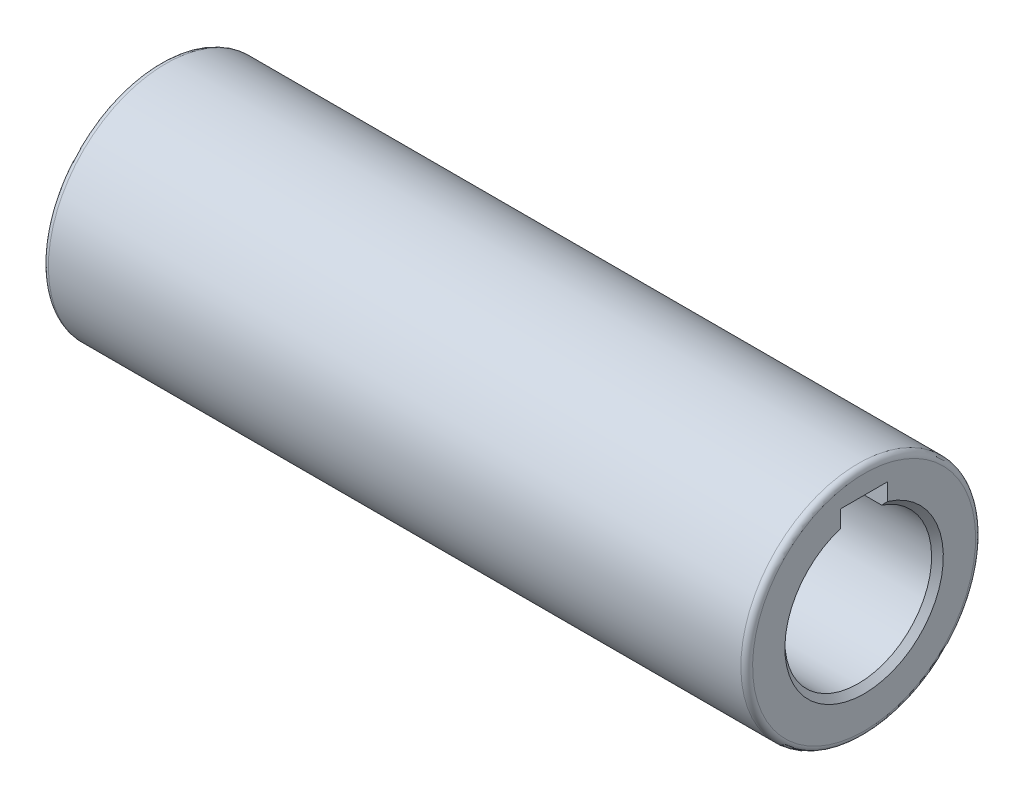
ISO-10303-21;
HEADER;
FILE_DESCRIPTION(('STEP AP214'),'2;1');
FILE_NAME('part.step','',(''),(''),'','','');
FILE_SCHEMA(('AUTOMOTIVE_DESIGN { 1 0 10303 214 1 1 1 1 }'));
ENDSEC;
DATA;
#1=APPLICATION_CONTEXT('core data for automotive mechanical design processes');
#2=APPLICATION_PROTOCOL_DEFINITION('international standard','automotive_design',2000,#1);
#3=PRODUCT_CONTEXT('',#1,'mechanical');
#4=PRODUCT('Part','Part','',(#3));
#5=PRODUCT_RELATED_PRODUCT_CATEGORY('part','',(#4));
#6=PRODUCT_DEFINITION_FORMATION('','',#4);
#7=PRODUCT_DEFINITION_CONTEXT('part definition',#1,'design');
#8=PRODUCT_DEFINITION('design','',#6,#7);
#9=PRODUCT_DEFINITION_SHAPE('','',#8);
#10=(LENGTH_UNIT() NAMED_UNIT(*) SI_UNIT(.MILLI.,.METRE.));
#11=(NAMED_UNIT(*) PLANE_ANGLE_UNIT() SI_UNIT($,.RADIAN.));
#12=(NAMED_UNIT(*) SI_UNIT($,.STERADIAN.) SOLID_ANGLE_UNIT());
#13=UNCERTAINTY_MEASURE_WITH_UNIT(LENGTH_MEASURE(1.E-05),#10,'distance_accuracy_value','');
#14=(GEOMETRIC_REPRESENTATION_CONTEXT(3) GLOBAL_UNCERTAINTY_ASSIGNED_CONTEXT((#13)) GLOBAL_UNIT_ASSIGNED_CONTEXT((#10,
#11,#12)) REPRESENTATION_CONTEXT('',''));
#15=CARTESIAN_POINT('',(0.,0.,0.));
#16=DIRECTION('',(0.,0.,1.));
#17=DIRECTION('',(1.,0.,0.));
#18=AXIS2_PLACEMENT_3D('',#15,#16,#17);
#19=CARTESIAN_POINT('',(59.,63.,95.0000000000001));
#20=DIRECTION('',(-1.,0.,0.));
#21=DIRECTION('',(0.,0.,1.));
#22=AXIS2_PLACEMENT_3D('',#19,#20,#21);
#23=CYLINDRICAL_SURFACE('',#22,20.);
#24=CARTESIAN_POINT('',(-59.,63.,95.));
#25=DIRECTION('',(1.,0.,0.));
#26=DIRECTION('',(0.,-1.,0.));
#27=AXIS2_PLACEMENT_3D('',#24,#25,#26);
#28=CIRCLE('',#27,20.);
#29=CARTESIAN_POINT('',(-59.,43.,95.));
#30=VERTEX_POINT('',#29);
#31=EDGE_CURVE('E111',#30,#30,#28,.F.);
#32=ORIENTED_EDGE('',*,*,#31,.F.);
#33=EDGE_LOOP('',(#32));
#34=FACE_BOUND('',#33,.T.);
#35=CARTESIAN_POINT('',(59.,63.,95.0000000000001));
#36=DIRECTION('',(1.,0.,0.));
#37=DIRECTION('',(0.,-1.,0.));
#38=AXIS2_PLACEMENT_3D('',#35,#36,#37);
#39=CIRCLE('',#38,20.);
#40=CARTESIAN_POINT('',(59.,43.,95.0000000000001));
#41=VERTEX_POINT('',#40);
#42=EDGE_CURVE('E168',#41,#41,#39,.T.);
#43=ORIENTED_EDGE('',*,*,#42,.F.);
#44=EDGE_LOOP('',(#43));
#45=FACE_BOUND('',#44,.T.);
#46=ADVANCED_FACE('F16',(#34,#45),#23,.T.);
#47=CARTESIAN_POINT('',(59.,63.,95.0000000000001));
#48=DIRECTION('',(1.,0.,0.));
#49=DIRECTION('',(0.,-1.,0.));
#50=AXIS2_PLACEMENT_3D('',#47,#48,#49);
#51=TOROIDAL_SURFACE('',#50,19.,1.);
#52=ORIENTED_EDGE('',*,*,#42,.T.);
#53=EDGE_LOOP('',(#52));
#54=FACE_BOUND('',#53,.T.);
#55=CARTESIAN_POINT('',(60.,63.,95.0000000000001));
#56=DIRECTION('',(-1.,0.,0.));
#57=DIRECTION('',(0.,-1.,0.));
#58=AXIS2_PLACEMENT_3D('',#55,#56,#57);
#59=CIRCLE('',#58,19.0000000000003);
#60=CARTESIAN_POINT('',(60.,43.9999999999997,95.0000000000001));
#61=VERTEX_POINT('',#60);
#62=EDGE_CURVE('E110',#61,#61,#59,.F.);
#63=ORIENTED_EDGE('',*,*,#62,.F.);
#64=EDGE_LOOP('',(#63));
#65=FACE_BOUND('',#64,.T.);
#66=ADVANCED_FACE('F160',(#54,#65),#51,.T.);
#67=CARTESIAN_POINT('',(-59.,63.,95.));
#68=DIRECTION('',(1.,0.,0.));
#69=DIRECTION('',(0.,-1.,0.));
#70=AXIS2_PLACEMENT_3D('',#67,#68,#69);
#71=TOROIDAL_SURFACE('',#70,19.,1.);
#72=CARTESIAN_POINT('',(-60.0000000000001,63.,95.));
#73=DIRECTION('',(1.,0.,0.));
#74=DIRECTION('',(0.,-1.,0.));
#75=AXIS2_PLACEMENT_3D('',#72,#73,#74);
#76=CIRCLE('',#75,19.0000000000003);
#77=CARTESIAN_POINT('',(-60.0000000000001,43.9999999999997,95.));
#78=VERTEX_POINT('',#77);
#79=EDGE_CURVE('E124',#78,#78,#76,.T.);
#80=ORIENTED_EDGE('',*,*,#79,.T.);
#81=EDGE_LOOP('',(#80));
#82=FACE_BOUND('',#81,.T.);
#83=ORIENTED_EDGE('',*,*,#31,.T.);
#84=EDGE_LOOP('',(#83));
#85=FACE_BOUND('',#84,.T.);
#86=ADVANCED_FACE('F148',(#82,#85),#71,.T.);
#87=CARTESIAN_POINT('',(60.,78.8,99.0000000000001));
#88=DIRECTION('',(0.,-1.,0.));
#89=DIRECTION('',(1.,0.,0.));
#90=AXIS2_PLACEMENT_3D('',#87,#88,#89);
#91=PLANE('',#90);
#92=DIRECTION('',(0.,0.,1.));
#93=VECTOR('',#92,1.);
#94=CARTESIAN_POINT('',(-60.0000000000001,78.8,114.228));
#95=LINE('',#94,#93);
#96=CARTESIAN_POINT('',(-59.9999999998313,78.8,99.));
#97=VERTEX_POINT('',#96);
#98=CARTESIAN_POINT('',(-60.,78.8000000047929,91.));
#99=VERTEX_POINT('',#98);
#100=EDGE_CURVE('E120',#97,#99,#95,.F.);
#101=ORIENTED_EDGE('',*,*,#100,.T.);
#102=DIRECTION('',(1.,0.,0.));
#103=VECTOR('',#102,1.);
#104=CARTESIAN_POINT('',(-60.,78.8000000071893,91.));
#105=LINE('',#104,#103);
#106=CARTESIAN_POINT('',(59.9999999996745,78.8000000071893,91.0000000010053));
#107=VERTEX_POINT('',#106);
#108=EDGE_CURVE('E75',#107,#99,#105,.F.);
#109=ORIENTED_EDGE('',*,*,#108,.F.);
#110=DIRECTION('',(0.,0.,1.));
#111=VECTOR('',#110,1.);
#112=CARTESIAN_POINT('',(60.,78.8000000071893,114.228));
#113=LINE('',#112,#111);
#114=CARTESIAN_POINT('',(60.,78.8000000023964,99.));
#115=VERTEX_POINT('',#114);
#116=EDGE_CURVE('E106',#115,#107,#113,.F.);
#117=ORIENTED_EDGE('',*,*,#116,.F.);
#118=DIRECTION('',(-1.,0.,0.));
#119=VECTOR('',#118,1.);
#120=CARTESIAN_POINT('',(-60.,78.8,99.));
#121=LINE('',#120,#119);
#122=EDGE_CURVE('E103',#97,#115,#121,.F.);
#123=ORIENTED_EDGE('',*,*,#122,.F.);
#124=EDGE_LOOP('',(#101,#109,#117,#123));
#125=FACE_BOUND('',#124,.T.);
#126=ADVANCED_FACE('F159',(#125),#91,.T.);
#127=CARTESIAN_POINT('',(59.9999999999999,43.772,114.228));
#128=DIRECTION('',(1.,0.,0.));
#129=DIRECTION('',(0.,1.,0.));
#130=AXIS2_PLACEMENT_3D('',#127,#128,#129);
#131=PLANE('',#130);
#132=ORIENTED_EDGE('',*,*,#62,.T.);
#133=EDGE_LOOP('',(#132));
#134=FACE_BOUND('',#133,.T.);
#135=DIRECTION('',(0.,-1.,0.));
#136=VECTOR('',#135,1.);
#137=CARTESIAN_POINT('',(59.9999999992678,78.8,91.));
#138=LINE('',#137,#136);
#139=CARTESIAN_POINT('',(59.9999999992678,75.893796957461,91.));
#140=VERTEX_POINT('',#139);
#141=EDGE_CURVE('E127',#140,#107,#138,.F.);
#142=ORIENTED_EDGE('',*,*,#141,.F.);
#143=CARTESIAN_POINT('',(59.9999999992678,63.,95.0000000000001));
#144=DIRECTION('',(1.,0.,0.));
#145=DIRECTION('',(0.,0.,-1.));
#146=AXIS2_PLACEMENT_3D('',#143,#144,#145);
#147=CIRCLE('',#146,13.4999999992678);
#148=CARTESIAN_POINT('',(59.9999999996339,75.8937969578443,99.));
#149=VERTEX_POINT('',#148);
#150=EDGE_CURVE('E70',#140,#149,#147,.F.);
#151=ORIENTED_EDGE('',*,*,#150,.T.);
#152=DIRECTION('',(0.,1.,0.));
#153=VECTOR('',#152,1.);
#154=CARTESIAN_POINT('',(60.,74.842719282,99.));
#155=LINE('',#154,#153);
#156=EDGE_CURVE('E99',#115,#149,#155,.F.);
#157=ORIENTED_EDGE('',*,*,#156,.F.);
#158=ORIENTED_EDGE('',*,*,#116,.T.);
#159=EDGE_LOOP('',(#142,#151,#157,#158));
#160=FACE_BOUND('',#159,.T.);
#161=ADVANCED_FACE('F179',(#134,#160),#131,.T.);
#162=CARTESIAN_POINT('',(-60.0000000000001,43.772,114.228));
#163=DIRECTION('',(1.,0.,0.));
#164=DIRECTION('',(0.,1.,0.));
#165=AXIS2_PLACEMENT_3D('',#162,#163,#164);
#166=PLANE('',#165);
#167=ORIENTED_EDGE('',*,*,#79,.F.);
#168=EDGE_LOOP('',(#167));
#169=FACE_BOUND('',#168,.T.);
#170=DIRECTION('',(0.,-1.,0.));
#171=VECTOR('',#170,1.);
#172=CARTESIAN_POINT('',(-60.,78.8,91.));
#173=LINE('',#172,#171);
#174=CARTESIAN_POINT('',(-59.9999999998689,75.8937969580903,91.));
#175=VERTEX_POINT('',#174);
#176=EDGE_CURVE('E130',#99,#175,#173,.T.);
#177=ORIENTED_EDGE('',*,*,#176,.F.);
#178=ORIENTED_EDGE('',*,*,#100,.F.);
#179=DIRECTION('',(0.,1.,0.));
#180=VECTOR('',#179,1.);
#181=CARTESIAN_POINT('',(-59.999999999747,74.842719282,99.));
#182=LINE('',#181,#180);
#183=CARTESIAN_POINT('',(-59.999999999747,75.8937969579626,99.));
#184=VERTEX_POINT('',#183);
#185=EDGE_CURVE('E117',#184,#97,#182,.T.);
#186=ORIENTED_EDGE('',*,*,#185,.F.);
#187=CARTESIAN_POINT('',(-59.999999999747,63.,95.));
#188=DIRECTION('',(-1.,0.,0.));
#189=DIRECTION('',(0.,0.,1.));
#190=AXIS2_PLACEMENT_3D('',#187,#188,#189);
#191=CIRCLE('',#190,13.4999999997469);
#192=EDGE_CURVE('E87',#184,#175,#191,.F.);
#193=ORIENTED_EDGE('',*,*,#192,.T.);
#194=EDGE_LOOP('',(#177,#178,#186,#193));
#195=FACE_BOUND('',#194,.T.);
#196=ADVANCED_FACE('F188',(#169,#195),#166,.F.);
#197=CARTESIAN_POINT('',(-60.,78.8,91.));
#198=DIRECTION('',(0.,0.,1.));
#199=DIRECTION('',(0.,-1.,0.));
#200=AXIS2_PLACEMENT_3D('',#197,#198,#199);
#201=PLANE('',#200);
#202=ORIENTED_EDGE('',*,*,#141,.T.);
#203=ORIENTED_EDGE('',*,*,#108,.T.);
#204=ORIENTED_EDGE('',*,*,#176,.T.);
#205=CARTESIAN_POINT('',(-59.999999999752,75.8937969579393,91.0000000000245));
#206=CARTESIAN_POINT('',(-59.8329808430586,75.7189527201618,91.0000000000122));
#207=CARTESIAN_POINT('',(-59.6661379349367,75.5439407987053,91.0000000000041));
#208=CARTESIAN_POINT('',(-59.3328046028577,75.1935815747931,90.9999999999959));
#209=CARTESIAN_POINT('',(-59.1663141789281,75.0182342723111,90.9999999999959));
#210=CARTESIAN_POINT('',(-59.0000000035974,74.8427192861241,91.));
#211=B_SPLINE_CURVE_WITH_KNOTS('',3,(#205,#206,#207,#208,#209,#210),.UNSPECIFIED.,.F.,.F.,(4,2,
4),(0.,0.725390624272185,1.45078130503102),.UNSPECIFIED.);
#212=CARTESIAN_POINT('',(-59.0000000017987,74.842719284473,91.0000000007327));
#213=VERTEX_POINT('',#212);
#214=EDGE_CURVE('E85',#175,#213,#211,.T.);
#215=ORIENTED_EDGE('',*,*,#214,.T.);
#216=DIRECTION('',(-1.,0.,0.));
#217=VECTOR('',#216,1.);
#218=CARTESIAN_POINT('',(59.,74.8427192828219,91.0000000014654));
#219=LINE('',#218,#217);
#220=CARTESIAN_POINT('',(59.0000000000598,74.8427192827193,91.0000000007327));
#221=VERTEX_POINT('',#220);
#222=EDGE_CURVE('E78',#213,#221,#219,.F.);
#223=ORIENTED_EDGE('',*,*,#222,.T.);
#224=CARTESIAN_POINT('',(59.0000000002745,74.8427192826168,91.));
#225=CARTESIAN_POINT('',(59.1663141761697,75.0182342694,91.));
#226=CARTESIAN_POINT('',(59.3328046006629,75.1935815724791,91.));
#227=CARTESIAN_POINT('',(59.6661379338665,75.5439407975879,91.));
#228=CARTESIAN_POINT('',(59.8329808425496,75.7189527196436,91.));
#229=CARTESIAN_POINT('',(59.9999999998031,75.8937969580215,91.));
#230=B_SPLINE_CURVE_WITH_KNOTS('',3,(#224,#225,#226,#227,#228,#229),.UNSPECIFIED.,.F.,.F.,(4,2,
4),(0.,0.725390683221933,1.45078130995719),.UNSPECIFIED.);
#231=EDGE_CURVE('E20',#221,#140,#230,.T.);
#232=ORIENTED_EDGE('',*,*,#231,.T.);
#233=EDGE_LOOP('',(#202,#203,#204,#215,#223,#232));
#234=FACE_BOUND('',#233,.T.);
#235=ADVANCED_FACE('F83',(#234),#201,.T.);
#236=CARTESIAN_POINT('',(60.0000000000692,63.,95.0000000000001));
#237=DIRECTION('',(1.,0.,0.));
#238=DIRECTION('',(0.,0.,-1.));
#239=AXIS2_PLACEMENT_3D('',#236,#237,#238);
#240=CONICAL_SURFACE('',#239,13.5000000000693,0.785398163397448);
#241=CARTESIAN_POINT('',(60.000000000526,75.8937969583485,98.9999999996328));
#242=CARTESIAN_POINT('',(59.8329808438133,75.7189527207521,98.9999999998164));
#243=CARTESIAN_POINT('',(59.6661379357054,75.5439407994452,98.9999999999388));
#244=CARTESIAN_POINT('',(59.332804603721,75.1935815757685,99.0000000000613));
#245=CARTESIAN_POINT('',(59.1663141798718,75.0182342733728,99.0000000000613));
#246=CARTESIAN_POINT('',(59.0000000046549,74.8427192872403,99.));
#247=B_SPLINE_CURVE_WITH_KNOTS('',3,(#241,#242,#243,#244,#245,#246),.UNSPECIFIED.,.F.,.F.,(4,2,
4),(0.,0.725390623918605,1.45078130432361),.UNSPECIFIED.);
#248=CARTESIAN_POINT('',(59.0000000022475,74.8427192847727,99.0000000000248));
#249=VERTEX_POINT('',#248);
#250=EDGE_CURVE('E102',#149,#249,#247,.T.);
#251=ORIENTED_EDGE('',*,*,#250,.F.);
#252=ORIENTED_EDGE('',*,*,#150,.F.);
#253=ORIENTED_EDGE('',*,*,#231,.F.);
#254=CARTESIAN_POINT('',(58.999999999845,63.,95.0000000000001));
#255=DIRECTION('',(-1.,0.,0.));
#256=DIRECTION('',(0.,0.,1.));
#257=AXIS2_PLACEMENT_3D('',#254,#255,#256);
#258=CIRCLE('',#257,12.5);
#259=EDGE_CURVE('E68',#221,#249,#258,.T.);
#260=ORIENTED_EDGE('',*,*,#259,.T.);
#261=EDGE_LOOP('',(#251,#252,#253,#260));
#262=FACE_BOUND('',#261,.T.);
#263=ADVANCED_FACE('F67',(#262),#240,.F.);
#264=CARTESIAN_POINT('',(-60.,74.842719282,99.));
#265=DIRECTION('',(0.,0.,-1.));
#266=DIRECTION('',(-1.,0.,0.));
#267=AXIS2_PLACEMENT_3D('',#264,#265,#266);
#268=PLANE('',#267);
#269=DIRECTION('',(-1.,0.,0.));
#270=VECTOR('',#269,1.);
#271=CARTESIAN_POINT('',(59.,74.8427192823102,99.0000000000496));
#272=LINE('',#271,#270);
#273=CARTESIAN_POINT('',(-59.0000000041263,74.8427192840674,99.0000000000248));
#274=VERTEX_POINT('',#273);
#275=EDGE_CURVE('E32',#249,#274,#272,.T.);
#276=ORIENTED_EDGE('',*,*,#275,.T.);
#277=CARTESIAN_POINT('',(-59.0000000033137,74.8427192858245,99.));
#278=CARTESIAN_POINT('',(-59.1663141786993,75.0182342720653,99.));
#279=CARTESIAN_POINT('',(-59.3328046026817,75.1935815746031,99.));
#280=CARTESIAN_POINT('',(-59.6661379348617,75.5439407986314,99.));
#281=CARTESIAN_POINT('',(-59.8329808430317,75.7189527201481,99.));
#282=CARTESIAN_POINT('',(-59.9999999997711,75.8937969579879,99.));
#283=B_SPLINE_CURVE_WITH_KNOTS('',3,(#277,#278,#279,#280,#281,#282),.UNSPECIFIED.,.F.,.F.,(4,2,
4),(0.,0.725390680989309,1.45078130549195),.UNSPECIFIED.);
#284=EDGE_CURVE('E40',#274,#184,#283,.T.);
#285=ORIENTED_EDGE('',*,*,#284,.T.);
#286=ORIENTED_EDGE('',*,*,#185,.T.);
#287=ORIENTED_EDGE('',*,*,#122,.T.);
#288=ORIENTED_EDGE('',*,*,#156,.T.);
#289=ORIENTED_EDGE('',*,*,#250,.T.);
#290=EDGE_LOOP('',(#276,#285,#286,#287,#288,#289));
#291=FACE_BOUND('',#290,.T.);
#292=ADVANCED_FACE('F225',(#291),#268,.T.);
#293=CARTESIAN_POINT('',(-59.999999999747,63.,95.));
#294=DIRECTION('',(-1.,0.,0.));
#295=DIRECTION('',(0.,0.,1.));
#296=AXIS2_PLACEMENT_3D('',#293,#294,#295);
#297=CONICAL_SURFACE('',#296,13.4999999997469,0.785398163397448);
#298=ORIENTED_EDGE('',*,*,#284,.F.);
#299=CARTESIAN_POINT('',(-59.0000000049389,63.,95.));
#300=DIRECTION('',(-1.,0.,0.));
#301=DIRECTION('',(0.,0.,1.));
#302=AXIS2_PLACEMENT_3D('',#299,#300,#301);
#303=CIRCLE('',#302,12.5);
#304=EDGE_CURVE('E11',#274,#213,#303,.F.);
#305=ORIENTED_EDGE('',*,*,#304,.T.);
#306=ORIENTED_EDGE('',*,*,#214,.F.);
#307=ORIENTED_EDGE('',*,*,#192,.F.);
#308=EDGE_LOOP('',(#298,#305,#306,#307));
#309=FACE_BOUND('',#308,.T.);
#310=ADVANCED_FACE('F228',(#309),#297,.F.);
#311=CARTESIAN_POINT('',(59.,63.,95.0000000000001));
#312=DIRECTION('',(-1.,0.,0.));
#313=DIRECTION('',(0.,0.,1.));
#314=AXIS2_PLACEMENT_3D('',#311,#312,#313);
#315=CYLINDRICAL_SURFACE('',#314,12.5);
#316=ORIENTED_EDGE('',*,*,#275,.F.);
#317=ORIENTED_EDGE('',*,*,#259,.F.);
#318=ORIENTED_EDGE('',*,*,#222,.F.);
#319=ORIENTED_EDGE('',*,*,#304,.F.);
#320=EDGE_LOOP('',(#316,#317,#318,#319));
#321=FACE_BOUND('',#320,.T.);
#322=ADVANCED_FACE('F18',(#321),#315,.F.);
#323=CLOSED_SHELL('',(#46,#66,#86,#126,#161,#196,#235,#263,#292,#310,#322));
#324=MANIFOLD_SOLID_BREP('B1',#323);
#325=ADVANCED_BREP_SHAPE_REPRESENTATION('',(#18,#324),#14);
#326=SHAPE_DEFINITION_REPRESENTATION(#9,#325);
ENDSEC;
END-ISO-10303-21;
